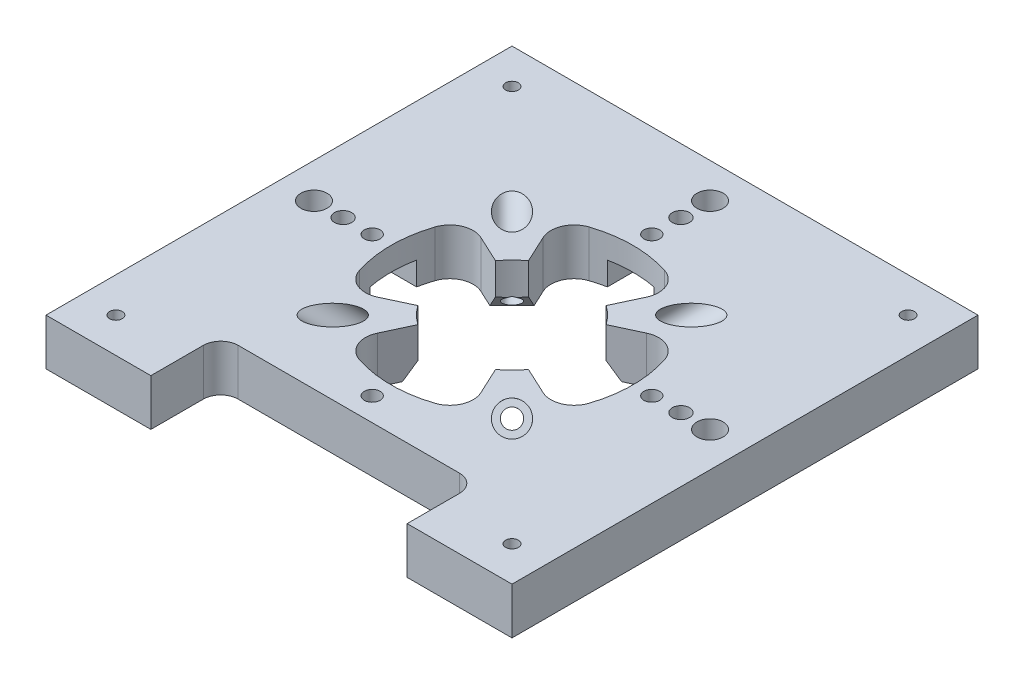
from build123d import *

# Parameters (mm, degrees)
SKETCH1_W                                      = 127
SKETCH1_H                                      = 127
BOSS_EXTRUDE1_DEPTH                            = 12.7
F_8_32_TAPPED_HOLE1_D                          = 3.4544
SKETCH4_R                                      = 18.415
CUT_EXTRUDE1_DEPTH                             = 12.7
CUT_EXTRUDE2_DEPTH                             = 12.7
CUT_EXTRUDE3_DEPTH                             = 12.7
CIRPATTERN1_COUNT                              = 4
CBORE_FOR_8_SOCKET_HEAD_CAP_SCREW1_D           = 4.4958
CBORE_FOR_8_SOCKET_HEAD_CAP_SCREW1_CBORE_D     = 7.9375
CBORE_FOR_8_SOCKET_HEAD_CAP_SCREW1_CBORE_DEPTH = 25.3746
CIRPATTERN2_COUNT                              = 4
CUT_EXTRUDE4_DEPTH                             = 5.08
CIRPATTERN3_COUNT                              = 4
F_18_0_1695_DIAMETER_HOLE1_D                   = 4.3053
F_13_0_185_DIAMETER_HOLE1_D                    = 4.699
F_9_32_0_28125_DIAMETER_HOLE1_D                = 7.14375
SKETCH21_W                                     = 34.29
SKETCH21_H                                     = 12.7
CUT_EXTRUDE5_DEPTH                             = 6.35
SKETCH22_W                                     = 12.7
SKETCH22_H                                     = 34.417
CUT_EXTRUDE6_DEPTH                             = 6.35
SKETCH23_R                                     = 5.4864
CUT_EXTRUDE7_DEPTH                             = 6.35


with BuildPart() as part:
    # Sketch1 → Boss-Extrude1 (new body)
    with BuildSketch(Plane(origin=(0, 0, 0), x_dir=(1, 0, 0), z_dir=(0, 1, 0))):
        Rectangle(SKETCH1_W, SKETCH1_H)
    extrude(amount=BOSS_EXTRUDE1_DEPTH)

    # 8-32 Tapped Hole1 (through all)
    with Locations(Plane(origin=(0, 12.7, 0), x_dir=(1, 0, 0), z_dir=(0, 1, 0))):
        with Locations((-53.975, 53.975), (53.975, 53.975), (53.975, -53.975), (-53.975, -53.975)):
            Hole(F_8_32_TAPPED_HOLE1_D / 2)

    # Sketch4 → Cut-Extrude1 (cut)
    with BuildSketch(Plane(origin=(0, 12.7, 0), x_dir=(1, 0, 0), z_dir=(0, 1, 0))):
        with Locations(Location((0, 0, 0), (0, 0, 270))):
            Circle(SKETCH4_R)
    extrude(amount=-CUT_EXTRUDE1_DEPTH, mode=Mode.SUBTRACT)

    # Sketch5 → Cut-Extrude2 (cut)
    with BuildSketch(Plane(origin=(0, 12.7, 0), x_dir=(1, 0, 0), z_dir=(0, 1, 0))):
        with BuildLine():
            Line((34.925, -63.5), (34.925, -49.2125))
            ThreePointArc((34.925, -49.2125), (33.530096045, -45.844903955), (30.1625, -44.45))
            Line((30.1625, -44.45), (-30.1625, -44.45))
            ThreePointArc((-30.1625, -44.45), (-33.530096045, -45.844903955), (-34.925, -49.2125))
            Line((-34.925, -49.2125), (-34.925, -63.5))
            Line((-34.925, -63.5), (34.925, -63.5))
        make_face()
    extrude(amount=-CUT_EXTRUDE2_DEPTH, mode=Mode.SUBTRACT)

    # Sketch6 → Cut-Extrude3 (cut)
    with BuildSketch(Plane(origin=(0, 12.7, 0), x_dir=(1, 0, 0), z_dir=(0, 1, 0))):
        with BuildLine():
            Line((7.62, 0), (-22.585297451, -14.084961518))
            ThreePointArc((-22.585297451, -14.084961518), (-27.788533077, -14.158634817), (-31.299692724, -10.317951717))
            ThreePointArc((-31.299692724, -10.317951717), (-32.9565, 0), (-31.299692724, 10.317951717))
            ThreePointArc((-31.299692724, 10.317951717), (-27.788533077, 14.158634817), (-22.585297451, 14.084961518))
            Line((-22.585297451, 14.084961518), (7.62, 0))
        make_face()
    cut_extrude3 = extrude(amount=-CUT_EXTRUDE3_DEPTH, mode=Mode.SUBTRACT)

    # CirPattern1: Cut-Extrude3 ×4 about axis
    cirpattern1_axis = Axis((0, 0, 0), (0, 1, 0))
    for i in range(1, CIRPATTERN1_COUNT):
        add(cut_extrude3.rotate(cirpattern1_axis, i * 360 / CIRPATTERN1_COUNT), mode=Mode.SUBTRACT)

    # CBORE for _8 Socket Head Cap Screw1 (through all)
    with Locations(Plane(origin=(29.059274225, 29.097603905, -29.059274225), x_dir=(-0.8166760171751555, 0.40833765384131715, -0.40779975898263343), z_dir=(0.5770964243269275, 0.5778576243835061, -0.5770964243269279))):
        with Locations((-4.802132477, -8.310234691)):
            cbore_for_8_socket_head_cap_screw1 = CounterBoreHole(CBORE_FOR_8_SOCKET_HEAD_CAP_SCREW1_D / 2, CBORE_FOR_8_SOCKET_HEAD_CAP_SCREW1_CBORE_D / 2, CBORE_FOR_8_SOCKET_HEAD_CAP_SCREW1_CBORE_DEPTH)

    # CirPattern2: CBORE for _8 Socket Head Cap Screw1 ×4 about axis
    cirpattern2_axis = Axis((0, 0, 0), (0, 1, 0))
    for i in range(1, CIRPATTERN2_COUNT):
        add(cbore_for_8_socket_head_cap_screw1.rotate(cirpattern2_axis, i * 360 / CIRPATTERN2_COUNT), mode=Mode.SUBTRACT)

    # Sketch14 → Cut-Extrude4 (cut, symmetric)
    with BuildSketch(Plane(origin=(0, 0, 0), x_dir=(0.7071067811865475, 0, -0.7071067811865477), z_dir=(0.7071067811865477, 0, 0.7071067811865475))):
        Polygon((21.114918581, 0), (16.57107529, 6.417500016), (12.027231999, 0), align=None)
    cut_extrude4 = extrude(amount=CUT_EXTRUDE4_DEPTH, both=True, mode=Mode.SUBTRACT)

    # CirPattern3: Cut-Extrude4 ×4 about axis
    cirpattern3_axis = Axis((0, 0, 0), (0, 1, 0))
    for i in range(1, CIRPATTERN3_COUNT):
        add(cut_extrude4.rotate(cirpattern3_axis, i * 360 / CIRPATTERN3_COUNT), mode=Mode.SUBTRACT)

    # 18 _0.1695_ Diameter Hole1 (through all)
    with Locations(Plane(origin=(0, 12.7, 0), x_dir=(1, 0, 0), z_dir=(0, 1, 0))):
        with Locations((-38.1, 0), (38.1, 0), (0, 38.1), (0, -38.1)):
            Hole(F_18_0_1695_DIAMETER_HOLE1_D / 2)

    # 13 _0.185_ Diameter Hole1 (through all)
    with Locations(Plane(origin=(0, 12.7, 0), x_dir=(1, 0, 0), z_dir=(0, 1, 0))):
        with Locations((-46.0375, 0), (46.0375, 0), (0, 46.0375)):
            Hole(F_13_0_185_DIAMETER_HOLE1_D / 2)

    # 9_32 _0.28125_ Diameter Hole1 (through all)
    with Locations(Plane(origin=(0, 0, 0), x_dir=(-1, 0, 0), z_dir=(0, -1, 0))):
        with Locations((-53.975, 0), (53.975, 0), (0, 53.975)):
            Hole(F_9_32_0_28125_DIAMETER_HOLE1_D / 2)

    # Sketch21 → Cut-Extrude5 (cut)
    with BuildSketch(Plane.XZ):
        with Locations((-46.355, 0)):
            Rectangle(SKETCH21_W, SKETCH21_H)
    extrude(amount=-CUT_EXTRUDE5_DEPTH, mode=Mode.SUBTRACT)

    # Sketch22 → Cut-Extrude6 (cut)
    with BuildSketch(Plane.XZ):
        with Locations((0, -46.2915)):
            Rectangle(SKETCH22_W, SKETCH22_H)
    extrude(amount=-CUT_EXTRUDE6_DEPTH, mode=Mode.SUBTRACT)

    # Sketch23 → Cut-Extrude7 (cut)
    with BuildSketch(Plane.XZ):
        with Locations(Location((53.975, 0, 0), (0, 0, 270))):
            Circle(SKETCH23_R)
    extrude(amount=-CUT_EXTRUDE7_DEPTH, mode=Mode.SUBTRACT)


solid = part.part
